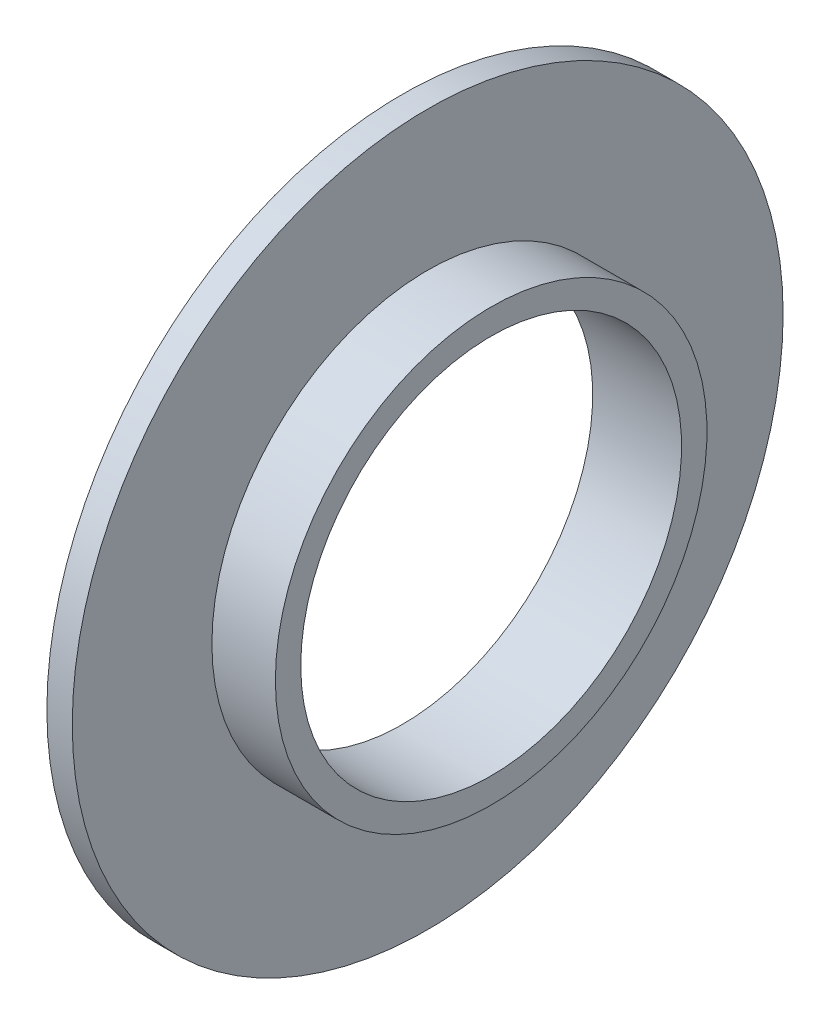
from build123d import *

# Parameters (mm, degrees)
ESQUISSE2_R             = 7.5
ENL_V_MAT_EXTRU_1_DEPTH = 21.105969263


with BuildPart() as part:
    # Esquisse1 → R_volution1 (revolve)
    with BuildSketch(Plane(origin=(0, 0, 0), x_dir=(1, 0, 0), z_dir=(0, 1, 0)), mode=Mode.PRIVATE) as r_volution1_sk:
        Polygon((-0.31147541, 8.5), (-2.81147541, 8.5), (-2.81147541, 14), (-3.81147541, 14), (-3.81147541, 0), (-1.905737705, 0), (-1.905737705, 7.5), (-0.31147541, 7.5), align=None)
    revolve(r_volution1_sk.sketch.rotate(Axis((-8.237704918, 0, 0), (1, 0, 0)), 180), axis=Axis((-8.237704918, 0, 0), (1, 0, 0)))

    # Esquisse2 → Enl_v. mat.-Extru.1 (cut, through all)
    with BuildSketch(Plane.ZY.offset(3.81147541)):
        Circle(ESQUISSE2_R)
    extrude(amount=-ENL_V_MAT_EXTRU_1_DEPTH, mode=Mode.SUBTRACT)


solid = part.part
